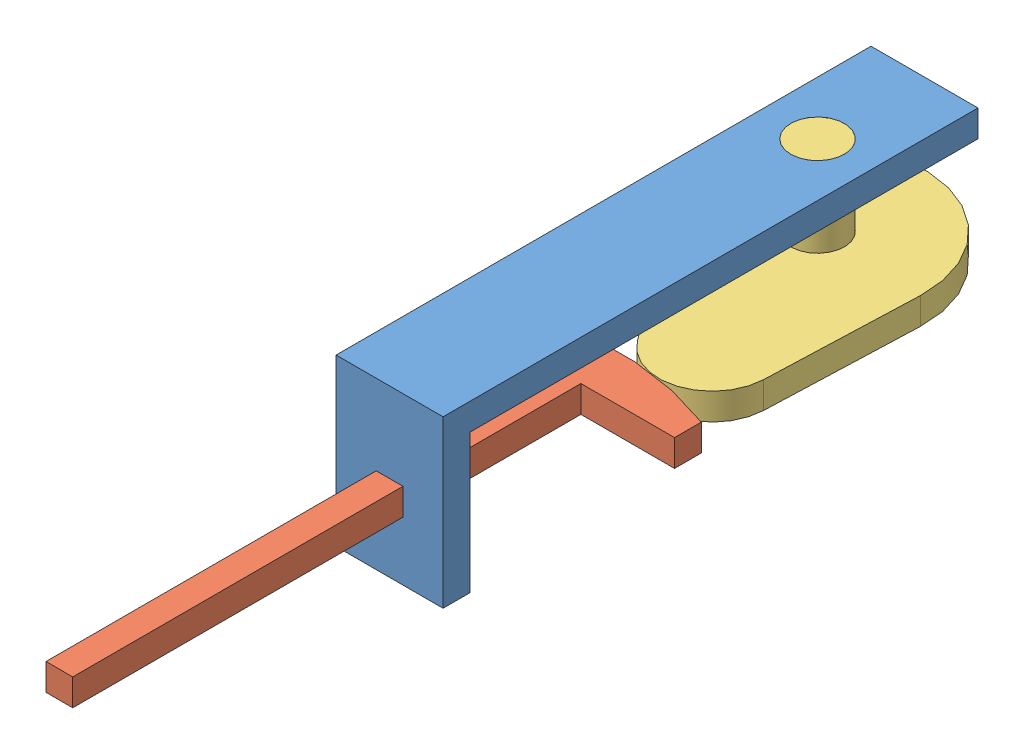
SolidWorks assembly cam.SLDASM, configuration Default (file format 4400). Lengths in mm.
Overall size (56.08 31 166.78).
3 component instances, 3 part files, 5 mates.
Components (placement in the parent):
- base-1: base.sldprt [Default] at (-37.3319 7.1229 25.152) size (20 31 100)
- follower-1: follower.sldprt [Default] at (-14.3411 0.4319 27.2317) size (40 5 103.71)
- cam-1: cam.sldprt [Default] at (-14.5222 5.4319 -25.6872) x (0.954457 0 -0.298349) z (0.298349 0 0.954457) size (40 20 60)
Mates (geometry in assembly coordinates):
- Coincident2: coincident anti-aligned: plane of base-1 through (-17.0222 5.4319 -45.6882) normal (1 0 0); plane of follower-1 through (-17.0222 5.4319 21.0412) normal (-1 0 0)
- Coincident3: coincident anti-aligned: plane of base-1 through (-17.0222 5.4319 -45.6882) normal (0 -1 0); plane of follower-1 through (-14.5222 5.4319 68.1533) normal (0 1 0)
- Concentric1: concentric aligned: cylinder of base-1 through (-14.5222 -10.5691 -25.6872) axis (0 1 0) radius 5; cylinder of cam-1 through (-14.5222 -13.7103 -25.6872) axis (0 1 0) radius 5
- Coincident5: coincident aligned: plane of follower-1 through (-14.5222 5.4319 68.1533) normal (0 1 0); plane of cam-1 through (-14.5222 5.4319 -25.6872) normal (0 1 0)
- CamMateTangent1: cam tangent: plane of cam-1; cylinder of cam-1 through (-14.5222 0.4319 -25.6872) axis (0 1 0) radius 20; plane of cam-1; cylinder of cam-1 through (-5.5717 0.4319 2.9465) axis (0 1 0) radius 10; cylinder of follower-1 through (-14.5222 5.4319 68.1533) axis (0 -1 0) radius 55.8183
